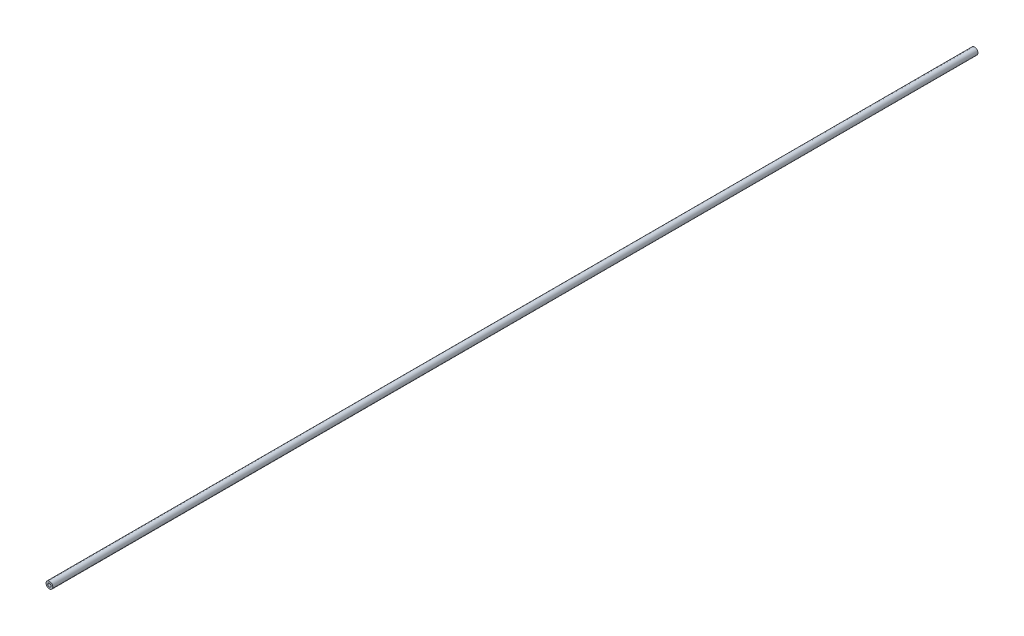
from build123d import *

# Parameters (mm, degrees)
ESQUISSE1_R        = 1.65
ESQUISSE1_R_2      = 0.8
BOSS_EXTRU_1_DEPTH = 450


with BuildPart() as part:
    # Esquisse1 → Boss.-Extru.1 (new body)
    with BuildSketch(Plane.XY):
        Circle(ESQUISSE1_R)
        Circle(ESQUISSE1_R_2, mode=Mode.SUBTRACT)
    extrude(amount=BOSS_EXTRU_1_DEPTH)


solid = part.part
